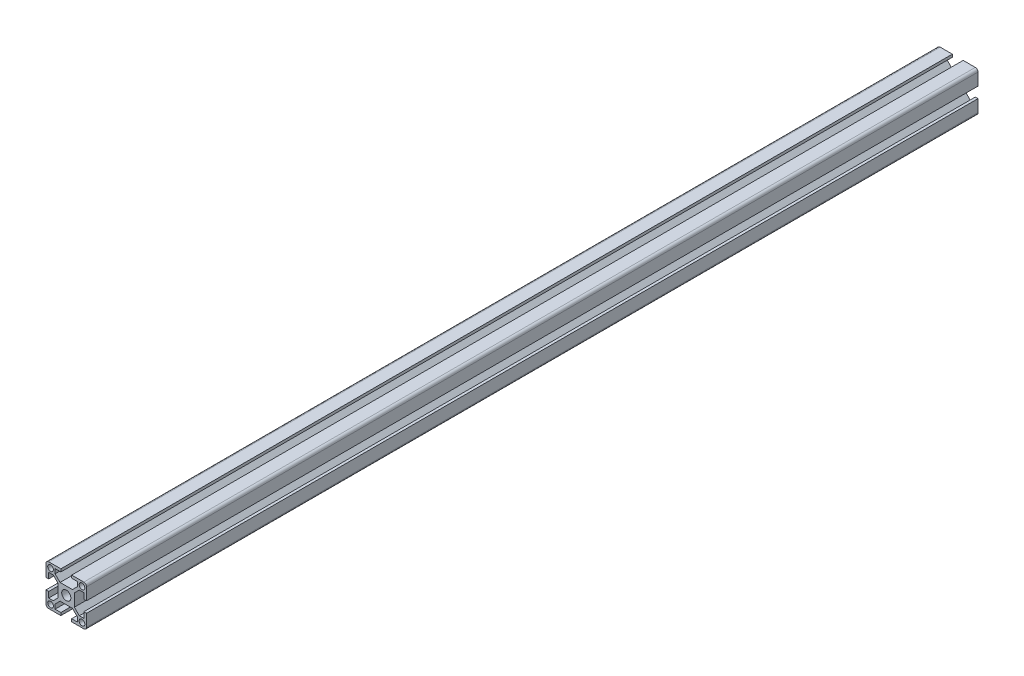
from build123d import *

# Parameters (mm, degrees)
SKETCH_1_R      = 2.1
SKETCH_1_R_2    = 3.4
EXTRUDE_1_DEPTH = 660


with BuildPart() as part:
    # Sketch 1 → Extrude 1 (new body)
    with BuildSketch(Plane.XY):
        with BuildLine():
            Line((-15, -4), (-15, -13))
            ThreePointArc((-15, -13), (-14.414213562, -14.414213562), (-13, -15))
            Line((-13, -15), (-4, -15))
            Line((-4, -15), (-4, -13))
            Line((-4, -13), (-8.25, -13))
            Line((-8.25, -13), (-8.25, -9.664213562))
            Line((-8.25, -9.664213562), (-4.585786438, -6))
            Line((-4.585786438, -6), (4.585786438, -6))
            Line((4.585786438, -6), (8.25, -9.664213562))
            Line((8.25, -9.664213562), (8.25, -13))
            Line((8.25, -13), (4, -13))
            Line((4, -13), (4, -15))
            Line((4, -15), (13, -15))
            ThreePointArc((13, -15), (14.414213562, -14.414213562), (15, -13))
            Line((15, -13), (15, -4))
            Line((15, -4), (13, -4))
            Line((13, -4), (13, -8.25))
            Line((13, -8.25), (9.664213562, -8.25))
            Line((9.664213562, -8.25), (6, -4.585786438))
            Line((6, -4.585786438), (6, 4.585786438))
            Line((6, 4.585786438), (9.664213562, 8.25))
            Line((9.664213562, 8.25), (13, 8.25))
            Line((13, 8.25), (13, 4))
            Line((13, 4), (15, 4))
            Line((15, 4), (15, 13))
            ThreePointArc((15, 13), (14.414213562, 14.414213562), (13, 15))
            Line((13, 15), (4, 15))
            Line((4, 15), (4, 13))
            Line((4, 13), (8.25, 13))
            Line((8.25, 13), (8.25, 9.664213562))
            Line((8.25, 9.664213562), (4.585786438, 6))
            Line((4.585786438, 6), (-4.585786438, 6))
            Line((-4.585786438, 6), (-8.25, 9.664213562))
            Line((-8.25, 9.664213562), (-8.25, 13))
            Line((-8.25, 13), (-4, 13))
            Line((-4, 13), (-4, 15))
            Line((-4, 15), (-13, 15))
            ThreePointArc((-13, 15), (-14.414213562, 14.414213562), (-15, 13))
            Line((-15, 13), (-15, 4))
            Line((-15, 4), (-13, 4))
            Line((-13, 4), (-13, 8.25))
            Line((-13, 8.25), (-9.664213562, 8.25))
            Line((-9.664213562, 8.25), (-6, 4.585786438))
            Line((-6, 4.585786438), (-6, -4.585786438))
            Line((-6, -4.585786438), (-9.664213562, -8.25))
            Line((-9.664213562, -8.25), (-13, -8.25))
            Line((-13, -8.25), (-13, -4))
            Line((-13, -4), (-15, -4))
        make_face()
        with Locations((11.625, 11.625)):
            Circle(SKETCH_1_R, mode=Mode.SUBTRACT)
        with Locations((-11.625, 11.625)):
            Circle(SKETCH_1_R, mode=Mode.SUBTRACT)
        with Locations(Location((11.625, -11.625, 0), (0, 0, 180))):
            Circle(SKETCH_1_R, mode=Mode.SUBTRACT)
        with Locations(Location((-11.625, -11.625, 0), (0, 0, 180))):
            Circle(SKETCH_1_R, mode=Mode.SUBTRACT)
        Circle(SKETCH_1_R_2, mode=Mode.SUBTRACT)
    extrude(amount=EXTRUDE_1_DEPTH)


solid = part.part
